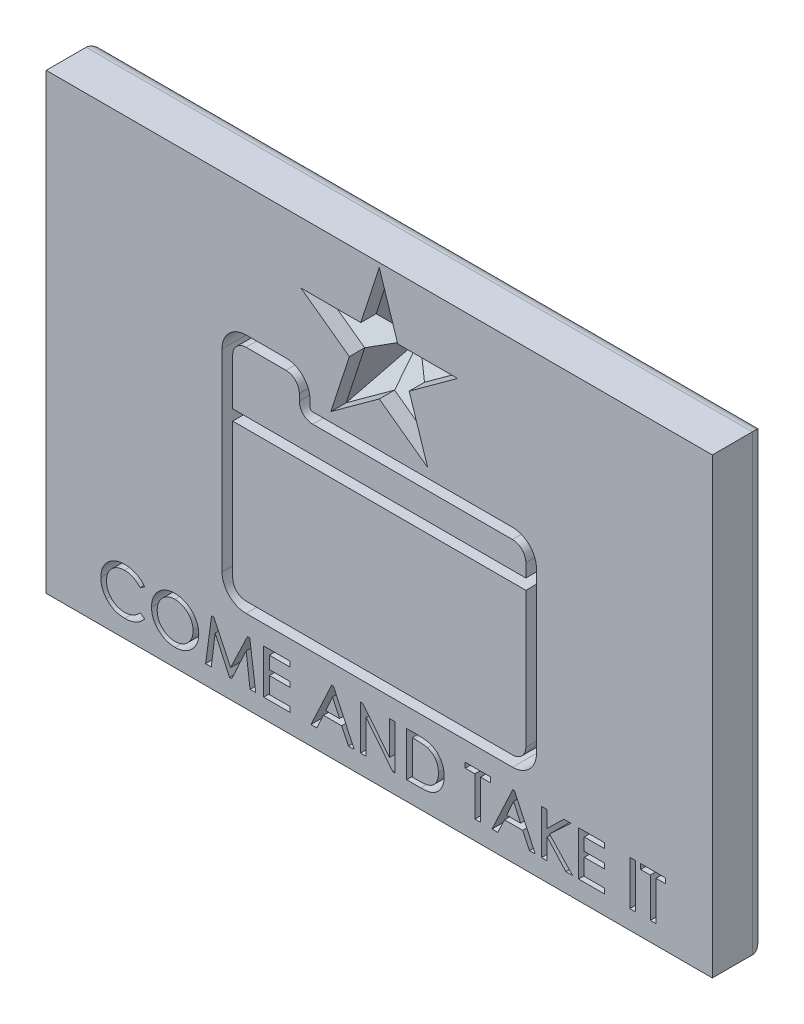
from build123d import *

# Parameters (mm, degrees)
SKETCH1_W           = 31.75
SKETCH1_H           = 21.59
BOSS_EXTRUDE1_DEPTH = 2.54
FILLET1_R           = 0.635
SKETCH2_W           = 0.271367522
SKETCH2_H           = 2.116666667
CUT_EXTRUDE1_DEPTH  = 1.905
CUT_EXTRUDE2_DEPTH  = 1.905
SKETCH4_W           = 13.97
SKETCH4_H           = 0.508
CUT_EXTRUDE3_DEPTH  = 1.905
CUT_EXTRUDE4_DEPTH  = 1.905
CHAMFER1_SIZE       = 1.17475


with BuildPart() as part:
    # Sketch1 → Boss-Extrude1 (new body)
    with BuildSketch(Plane.XY):
        Rectangle(SKETCH1_W, SKETCH1_H)
    extrude(amount=BOSS_EXTRUDE1_DEPTH)

    # Fillet1
    fillet1_edges = [part.edges().sort_by_distance(p)[0] for p in [
        (0, -10.795, 0),
        (-15.875, 0, 0),
        (0, 10.795, 0),
        (15.875, 0, 0),
    ]]
    fillet(fillet1_edges, radius=FILLET1_R)

    # Sketch2 → Cut-Extrude1 (cut)
    # profile 1 of 13: a face of its own
    with BuildSketch(Plane.XY.offset(2.54)):
        with BuildLine():
            Line((-11.18034188, -8.173790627), (-11.396587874, -8.323042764))
            add(Edge.make_bspline(
                [(-11.396587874, -8.323042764), (-11.422487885, -8.294673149), (-11.473190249, -8.239136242), (-11.556684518, -8.166386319), (-11.644064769, -8.105155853), (-11.735454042, -8.055648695), (-11.830949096, -8.016892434), (-11.931052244, -7.989963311), (-12.035868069, -7.973367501), (-12.107310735, -7.971311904), (-12.143696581, -7.970264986)],
                knots=[0, 0, 0, 0, 1.078723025, 2.111729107, 3.104379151, 4.071093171, 5.02612831, 5.993405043, 6.978038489, 8, 8, 8, 8], degree=3))
            add(Edge.make_bspline(
                [(-12.143696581, -7.970264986), (-12.162651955, -7.970538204), (-12.20036177, -7.971081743), (-12.256243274, -7.977057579), (-12.311270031, -7.985236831), (-12.365390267, -7.99766436), (-12.418507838, -8.013911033), (-12.470984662, -8.032752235), (-12.52202604, -8.05608894), (-12.572127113, -8.082027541), (-12.620536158, -8.111202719), (-12.666133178, -8.143606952), (-12.70974775, -8.177792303), (-12.750146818, -8.215375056), (-12.787699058, -8.255695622), (-12.82322706, -8.298246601), (-12.855832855, -8.34358146), (-12.885391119, -8.391564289), (-12.912352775, -8.441480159), (-12.934979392, -8.493694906), (-12.954623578, -8.54732275), (-12.970925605, -8.602642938), (-12.982982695, -8.659823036), (-12.991922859, -8.718707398), (-12.997652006, -8.779165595), (-12.998218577, -8.820113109), (-12.998504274, -8.840761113)],
                knots=[0, 0, 0, 0, 1.002068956, 1.993515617, 2.969284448, 3.943018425, 4.926742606, 5.905741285, 6.889351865, 7.892340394, 8.888397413, 9.875523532, 10.849114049, 11.817064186, 12.790109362, 13.76151668, 14.746886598, 15.740472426, 16.740336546, 17.744438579, 18.747064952, 19.759451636, 20.791569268, 21.834966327, 22.908270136, 24, 24, 24, 24], degree=3))
            add(Edge.make_bspline(
                [(-12.998504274, -8.840761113), (-12.997850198, -8.8717561), (-12.996569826, -8.932429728), (-12.984194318, -9.021271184), (-12.964884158, -9.105933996), (-12.937739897, -9.18641148), (-12.902666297, -9.262612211), (-12.859756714, -9.334411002), (-12.808764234, -9.401982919), (-12.750534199, -9.464454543), (-12.687057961, -9.521787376), (-12.61826118, -9.570840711), (-12.546499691, -9.613437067), (-12.470355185, -9.64725818), (-12.390903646, -9.674156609), (-12.307530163, -9.693210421), (-12.220493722, -9.704901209), (-12.161117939, -9.706304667), (-12.130976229, -9.707017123)],
                knots=[0, 0, 0, 0, 1.083728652, 2.12143175, 3.131304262, 4.117911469, 5.086904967, 6.060353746, 7.03835, 8.042493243, 9.043967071, 10.025107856, 10.993520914, 11.958418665, 12.934074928, 13.923564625, 14.94591178, 16, 16, 16, 16], degree=3))
            add(Edge.make_bspline(
                [(-12.130976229, -9.707017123), (-12.095998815, -9.705988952), (-12.026916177, -9.703958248), (-11.925338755, -9.68685354), (-11.827466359, -9.659226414), (-11.733193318, -9.620280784), (-11.642442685, -9.570399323), (-11.555640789, -9.509198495), (-11.472303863, -9.437231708), (-11.42164898, -9.382323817), (-11.39573985, -9.354239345)],
                knots=[0, 0, 0, 0, 0.996377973, 1.967910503, 2.926842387, 3.889624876, 4.868586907, 5.872161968, 6.91164629, 8, 8, 8, 8], degree=3))
            Line((-11.39573985, -9.354239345), (-11.18034188, -9.502643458))
            add(Edge.make_bspline(
                [(-11.18034188, -9.502643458), (-11.194285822, -9.520326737), (-11.22199062, -9.555461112), (-11.266731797, -9.605157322), (-11.313726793, -9.651896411), (-11.363438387, -9.695244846), (-11.415813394, -9.735160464), (-11.470606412, -9.772105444), (-11.52776479, -9.806021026), (-11.587257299, -9.836544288), (-11.648745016, -9.863863), (-11.712353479, -9.886868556), (-11.777473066, -9.907163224), (-11.844677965, -9.923051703), (-11.913705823, -9.935928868), (-11.98466355, -9.944572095), (-12.057240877, -9.950422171), (-12.106230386, -9.950970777), (-12.130976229, -9.951247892)],
                knots=[0, 0, 0, 0, 0.990136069, 1.967271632, 2.938597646, 3.903378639, 4.8655934, 5.832714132, 6.808088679, 7.786607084, 8.77175572, 9.76479442, 10.759640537, 11.769709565, 12.799869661, 13.846050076, 14.911985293, 16, 16, 16, 16], degree=3))
            add(Edge.make_bspline(
                [(-12.130976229, -9.951247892), (-12.153741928, -9.951093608), (-12.19861725, -9.950789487), (-12.264936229, -9.945679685), (-12.329497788, -9.938770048), (-12.392127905, -9.928403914), (-12.45312211, -9.915990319), (-12.511982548, -9.899531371), (-12.569507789, -9.881171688), (-12.624860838, -9.858968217), (-12.678459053, -9.834276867), (-12.730490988, -9.807215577), (-12.78044475, -9.776682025), (-12.828361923, -9.742972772), (-12.874806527, -9.706936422), (-12.919308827, -9.667770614), (-12.962331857, -9.625974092), (-12.988941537, -9.595821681), (-13.002320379, -9.580661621)],
                knots=[0, 0, 0, 0, 1.116169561, 2.200172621, 3.260333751, 4.299600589, 5.312386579, 6.311224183, 7.295427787, 8.272379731, 9.233840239, 10.188782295, 11.146938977, 12.102635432, 13.060741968, 14.028403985, 15.00871894, 16, 16, 16, 16], degree=3))
            add(Edge.make_bspline(
                [(-13.002320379, -9.580661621), (-13.02376716, -9.55433987), (-13.066278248, -9.502165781), (-13.120459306, -9.41735956), (-13.167191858, -9.329093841), (-13.204322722, -9.23611106), (-13.233671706, -9.139507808), (-13.255063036, -9.038989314), (-13.267388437, -8.934211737), (-13.269034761, -8.862983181), (-13.269871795, -8.826768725)],
                knots=[0, 0, 0, 0, 0.995996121, 1.974230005, 2.94855815, 3.923972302, 4.908363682, 5.909282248, 6.937024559, 8, 8, 8, 8], degree=3))
            add(Edge.make_bspline(
                [(-13.269871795, -8.826768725), (-13.268926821, -8.788697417), (-13.267067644, -8.713794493), (-13.251409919, -8.603839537), (-13.225897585, -8.498656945), (-13.190831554, -8.397792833), (-13.144365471, -8.302072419), (-13.088952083, -8.2102588), (-13.021938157, -8.124062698), (-12.946621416, -8.042737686), (-12.863757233, -7.968310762), (-12.774270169, -7.903770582), (-12.680071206, -7.84861777), (-12.580813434, -7.803437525), (-12.476227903, -7.76843727), (-12.366487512, -7.744223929), (-12.251827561, -7.728891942), (-12.173709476, -7.726998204), (-12.133944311, -7.726034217)],
                knots=[0, 0, 0, 0, 1.034323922, 2.034967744, 3.011348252, 3.972313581, 4.931003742, 5.898099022, 6.881526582, 7.89265862, 8.907395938, 9.903191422, 10.886146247, 11.869423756, 12.861842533, 13.877618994, 14.91962492, 16, 16, 16, 16], degree=3))
            add(Edge.make_bspline(
                [(-12.133944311, -7.726034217), (-12.108917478, -7.726324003), (-12.059366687, -7.726897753), (-11.985901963, -7.732566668), (-11.914301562, -7.741871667), (-11.844551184, -7.754688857), (-11.77644438, -7.770527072), (-11.710341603, -7.79117876), (-11.645868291, -7.814770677), (-11.583458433, -7.842008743), (-11.523265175, -7.872309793), (-11.465970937, -7.90649326), (-11.411179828, -7.943247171), (-11.359328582, -7.983337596), (-11.310071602, -8.026103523), (-11.263649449, -8.072037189), (-11.220303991, -8.12132488), (-11.193707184, -8.15624349), (-11.18034188, -8.173790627)],
                knots=[0, 0, 0, 0, 1.097463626, 2.172875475, 3.229307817, 4.262776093, 5.282168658, 6.293918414, 7.298043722, 8.291879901, 9.278790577, 10.251524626, 11.216027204, 12.170719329, 13.124142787, 14.075306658, 15.032812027, 16, 16, 16, 16], degree=3))
        make_face()
    # profile 2 of 13: a face of its own
    with BuildSketch(Plane.XY.offset(2.54)):
        with BuildLine():
            add(Edge.make_bspline(
                [(-9.755238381, -7.726034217), (-9.714624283, -7.726971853), (-9.634796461, -7.728814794), (-9.51768955, -7.744527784), (-9.40585614, -7.769665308), (-9.299461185, -7.805570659), (-9.198432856, -7.851576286), (-9.102611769, -7.907770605), (-9.012282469, -7.974323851), (-8.928549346, -8.050382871), (-8.852488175, -8.13323412), (-8.785081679, -8.220813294), (-8.729108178, -8.313508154), (-8.682317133, -8.409977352), (-8.64691212, -8.511115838), (-8.620680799, -8.616066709), (-8.60521022, -8.725533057), (-8.603313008, -8.800007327), (-8.602350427, -8.837793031)],
                knots=[0, 0, 0, 0, 1.090651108, 2.14369656, 3.167927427, 4.165692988, 5.154576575, 6.145033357, 7.14440862, 8.163220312, 9.178978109, 10.162394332, 11.12677451, 12.082874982, 13.037579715, 13.999894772, 14.985214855, 16, 16, 16, 16], degree=3))
            add(Edge.make_bspline(
                [(-8.602350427, -8.837793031), (-8.6032945, -8.875300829), (-8.605155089, -8.949221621), (-8.620922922, -9.058020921), (-8.646343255, -9.162844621), (-8.681942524, -9.263896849), (-8.728642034, -9.360406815), (-8.784895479, -9.45318423), (-8.851896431, -9.541342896), (-8.927673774, -9.62477411), (-9.010947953, -9.701106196), (-9.100362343, -9.768142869), (-9.194832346, -9.824566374), (-9.293887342, -9.871536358), (-9.398337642, -9.906800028), (-9.507403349, -9.932949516), (-9.621513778, -9.948399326), (-9.699222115, -9.950288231), (-9.738701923, -9.951247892)],
                knots=[0, 0, 0, 0, 1.015667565, 2.001689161, 2.971180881, 3.933912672, 4.898051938, 5.870540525, 6.8683264, 7.892867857, 8.919988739, 9.923897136, 10.914753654, 11.896185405, 12.887840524, 13.895451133, 14.930781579, 16, 16, 16, 16], degree=3))
            add(Edge.make_bspline(
                [(-9.738701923, -9.951247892), (-9.777200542, -9.950317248), (-9.852954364, -9.948486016), (-9.964086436, -9.932623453), (-10.070708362, -9.907894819), (-10.172682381, -9.87235508), (-10.270170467, -9.827024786), (-10.362617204, -9.770793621), (-10.450839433, -9.705301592), (-10.533159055, -9.630274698), (-10.608286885, -9.5481158), (-10.674185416, -9.46066078), (-10.730232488, -9.36902217), (-10.7758258, -9.273095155), (-10.811344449, -9.172788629), (-10.835984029, -9.068126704), (-10.851935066, -8.95940769), (-10.853769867, -8.885480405), (-10.854700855, -8.847969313)],
                knots=[0, 0, 0, 0, 1.056734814, 2.079339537, 3.076314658, 4.058285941, 5.039336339, 6.023146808, 7.024524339, 8.052147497, 9.076900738, 10.077495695, 11.054668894, 12.021676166, 12.988994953, 13.970866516, 14.970407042, 16, 16, 16, 16], degree=3))
            add(Edge.make_bspline(
                [(-10.854700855, -8.847969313), (-10.854377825, -8.822791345), (-10.853735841, -8.77275304), (-10.845995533, -8.698449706), (-10.834786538, -8.625333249), (-10.818637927, -8.553649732), (-10.79780879, -8.4833864), (-10.772135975, -8.414690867), (-10.742731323, -8.346982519), (-10.707658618, -8.281605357), (-10.669579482, -8.218179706), (-10.627265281, -8.158409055), (-10.582506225, -8.101565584), (-10.533417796, -8.049166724), (-10.48164127, -7.999676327), (-10.426330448, -7.953858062), (-10.3678245, -7.911297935), (-10.30587123, -7.872943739), (-10.241997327, -7.838255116), (-10.176152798, -7.808487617), (-10.109231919, -7.782938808), (-10.040921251, -7.762231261), (-9.971402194, -7.745883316), (-9.900523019, -7.734751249), (-9.828340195, -7.72699559), (-9.779710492, -7.726356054), (-9.755238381, -7.726034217)],
                knots=[0, 0, 0, 0, 1.036913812, 2.060746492, 3.074578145, 4.08324605, 5.085523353, 6.091481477, 7.103103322, 8.124200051, 9.145827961, 10.149052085, 11.139400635, 12.124186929, 13.104469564, 14.088618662, 15.081002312, 16.082788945, 17.088477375, 18.073521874, 19.057670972, 20.037642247, 21.012252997, 21.997331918, 22.992189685, 24, 24, 24, 24], degree=3))
        make_face()
        with BuildLine():
            add(Edge.make_bspline(
                [(-9.746334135, -7.970264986), (-9.764158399, -7.970547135), (-9.799611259, -7.971108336), (-9.852426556, -7.976982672), (-9.904694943, -7.985806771), (-9.956506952, -7.998216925), (-10.007905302, -8.01372367), (-10.058447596, -8.03356115), (-10.108622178, -8.056258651), (-10.157534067, -8.083163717), (-10.205214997, -8.112369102), (-10.250314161, -8.144973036), (-10.293349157, -8.179629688), (-10.333699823, -8.217506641), (-10.371290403, -8.25810801), (-10.406329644, -8.301367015), (-10.439084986, -8.347134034), (-10.46883914, -8.395726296), (-10.496320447, -8.446138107), (-10.519453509, -8.498695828), (-10.539048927, -8.552840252), (-10.555131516, -8.608514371), (-10.568016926, -8.665828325), (-10.576637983, -8.724803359), (-10.582530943, -8.785378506), (-10.583063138, -8.826330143), (-10.583333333, -8.84712129)],
                knots=[0, 0, 0, 0, 0.951425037, 1.892405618, 2.834142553, 3.780555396, 4.735506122, 5.698386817, 6.677778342, 7.674036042, 8.677244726, 9.661625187, 10.643485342, 11.625954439, 12.613944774, 13.595804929, 14.596853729, 15.616869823, 16.636634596, 17.660413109, 18.67984269, 19.709280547, 20.753005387, 21.813969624, 22.890152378, 24, 24, 24, 24], degree=3))
            add(Edge.make_bspline(
                [(-10.583333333, -8.84712129), (-10.582676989, -8.877410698), (-10.581389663, -8.936819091), (-10.568974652, -9.023959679), (-10.549727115, -9.107228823), (-10.522483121, -9.186542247), (-10.487403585, -9.261875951), (-10.444468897, -9.333208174), (-10.393607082, -9.40071766), (-10.335424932, -9.46310712), (-10.272349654, -9.52011376), (-10.205445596, -9.569788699), (-10.136244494, -9.612743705), (-10.063635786, -9.647173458), (-9.988331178, -9.674005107), (-9.910202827, -9.693097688), (-9.829236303, -9.704902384), (-9.774217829, -9.706305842), (-9.746334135, -9.707017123)],
                knots=[0, 0, 0, 0, 1.087324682, 2.132633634, 3.154656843, 4.153212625, 5.138884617, 6.133989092, 7.13811672, 8.169089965, 9.193543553, 10.187520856, 11.158295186, 12.114249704, 13.068004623, 14.02467326, 14.998892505, 16, 16, 16, 16], degree=3))
            add(Edge.make_bspline(
                [(-9.746334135, -9.707017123), (-9.726533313, -9.70673423), (-9.687276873, -9.706173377), (-9.629083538, -9.70038099), (-9.572041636, -9.691449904), (-9.516117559, -9.679427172), (-9.461477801, -9.662845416), (-9.407710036, -9.643769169), (-9.355404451, -9.619979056), (-9.304185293, -9.593660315), (-9.255360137, -9.563392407), (-9.208378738, -9.531215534), (-9.16419051, -9.49620444), (-9.123642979, -9.457659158), (-9.085083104, -9.417325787), (-9.049557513, -9.374072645), (-9.016817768, -9.328182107), (-8.987192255, -9.279801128), (-8.960619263, -9.22950924), (-8.937000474, -9.177679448), (-8.917803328, -9.124235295), (-8.901330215, -9.069699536), (-8.88918447, -9.013515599), (-8.880402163, -8.956023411), (-8.874539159, -8.897134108), (-8.873993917, -8.857453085), (-8.873717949, -8.837369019)],
                knots=[0, 0, 0, 0, 1.036970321, 2.055862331, 3.060095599, 4.060719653, 5.049301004, 6.049377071, 7.046955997, 8.056986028, 9.063944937, 10.053856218, 11.039021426, 12.013303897, 12.982198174, 13.960523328, 14.942567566, 15.933032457, 16.929951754, 17.920776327, 18.913894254, 19.902475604, 20.903099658, 21.921964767, 22.948227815, 24, 24, 24, 24], degree=3))
            add(Edge.make_bspline(
                [(-8.873717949, -8.837369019), (-8.873995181, -8.817426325), (-8.874542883, -8.778027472), (-8.880372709, -8.719698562), (-8.88917418, -8.662909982), (-8.901405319, -8.607455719), (-8.917719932, -8.553578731), (-8.937015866, -8.500866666), (-8.960620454, -8.449880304), (-8.987208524, -8.400444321), (-9.016891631, -8.352705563), (-9.050011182, -8.307559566), (-9.085657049, -8.264484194), (-9.124357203, -8.224114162), (-9.166137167, -8.186302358), (-9.210600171, -8.150765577), (-9.257880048, -8.117366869), (-9.308093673, -8.08728911), (-9.359900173, -8.059652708), (-9.413023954, -8.0360847), (-9.466546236, -8.015458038), (-9.520960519, -7.998887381), (-9.576256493, -7.986252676), (-9.632296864, -7.976826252), (-9.68911573, -7.971159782), (-9.727241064, -7.970563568), (-9.746334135, -7.970264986)],
                knots=[0, 0, 0, 0, 1.048789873, 2.071992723, 3.080474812, 4.070813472, 5.056451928, 6.039816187, 7.021295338, 8.009314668, 8.991328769, 9.975844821, 10.952581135, 11.930703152, 12.91499457, 13.914777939, 14.923479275, 15.957618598, 16.991998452, 18.010408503, 19.012925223, 20.00783076, 20.999814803, 21.994803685, 22.995802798, 24, 24, 24, 24], degree=3))
        make_face(mode=Mode.SUBTRACT)
    # profile 3 of 13: a face of its own
    with BuildSketch(Plane.XY.offset(2.54)):
        Polygon((-8.276709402, -9.896974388), (-7.993893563, -7.780307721), (-7.887042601, -7.780307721), (-7.084388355, -9.462786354), (-6.281734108, -7.780307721), (-6.173187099, -7.780307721), (-5.888675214, -9.896974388), (-6.157922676, -9.896974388), (-6.346183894, -8.40445302), (-7.033082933, -9.896974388), (-7.135693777, -9.896974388), (-7.820472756, -8.40445302), (-8.007885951, -9.896974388), align=None)
    # profile 4 of 13: a face of its own
    with BuildSketch(Plane.XY.offset(2.54)):
        Polygon((-5.508760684, -7.780307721), (-4.260470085, -7.780307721), (-4.260470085, -8.02453849), (-5.237393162, -8.02453849), (-5.237393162, -8.621547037), (-4.260470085, -8.621547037), (-4.260470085, -8.865777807), (-5.237393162, -8.865777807), (-5.237393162, -9.652743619), (-4.260470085, -9.652743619), (-4.260470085, -9.896974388), (-5.508760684, -9.896974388), align=None)
    # profile 5 of 13: a face of its own
    with BuildSketch(Plane.XY.offset(2.54)):
        Polygon((-2.184508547, -7.780307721), (-1.194017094, -9.896974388), (-1.472592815, -9.896974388), (-1.793993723, -9.218555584), (-2.659825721, -9.218555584), (-2.981226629, -9.896974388), (-3.256410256, -9.896974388), (-2.269310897, -7.780307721), align=None)
        Polygon((-2.226909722, -8.242904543), (-2.556366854, -8.974324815), (-1.894060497, -8.974324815), align=None, mode=Mode.SUBTRACT)
    # profile 6 of 13: a face of its own
    with BuildSketch(Plane.XY.offset(2.54)):
        Polygon((-0.895512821, -9.896974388), (-0.895512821, -7.780307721), (-0.795022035, -7.780307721), (0.488461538, -9.388584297), (0.488461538, -7.780307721), (0.75982906, -7.780307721), (0.75982906, -9.896974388), (0.648737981, -9.896974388), (-0.624145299, -8.29293793), (-0.624145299, -9.896974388), align=None)
    # profile 7 of 13: a face of its own
    with BuildSketch(Plane.XY.offset(2.54)):
        with BuildLine():
            Line((1.302564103, -9.896974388), (1.302564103, -7.780307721))
            Line((1.302564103, -7.780307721), (1.750744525, -7.780307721))
            add(Edge.make_bspline(
                [(1.750744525, -7.780307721), (1.788484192, -7.780570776), (1.861152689, -7.781077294), (1.966205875, -7.784399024), (2.063088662, -7.790110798), (2.152008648, -7.798720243), (2.2328765, -7.808845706), (2.305666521, -7.822241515), (2.370656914, -7.83668213), (2.410452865, -7.84996211), (2.429163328, -7.856205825)],
                knots=[0, 0, 0, 0, 1.321377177, 2.544338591, 3.679698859, 4.71869479, 5.671952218, 6.531967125, 7.309789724, 8, 8, 8, 8], degree=3))
            add(Edge.make_bspline(
                [(2.429163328, -7.856205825), (2.45536003, -7.866077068), (2.507065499, -7.885560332), (2.580325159, -7.92213293), (2.649537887, -7.962256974), (2.713841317, -8.007802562), (2.773112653, -8.058482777), (2.828369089, -8.113190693), (2.877905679, -8.173521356), (2.923281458, -8.237772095), (2.963486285, -8.306017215), (2.998287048, -8.377360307), (3.027679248, -8.451664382), (3.051851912, -8.528740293), (3.070377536, -8.608726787), (3.084066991, -8.691406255), (3.092246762, -8.776992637), (3.093138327, -8.835089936), (3.093589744, -8.864505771)],
                knots=[0, 0, 0, 0, 1.037989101, 2.048720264, 3.03347809, 4.003905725, 4.967380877, 5.923996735, 6.884742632, 7.859453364, 8.839691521, 9.819957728, 10.801471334, 11.80152298, 12.813966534, 13.844978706, 14.908869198, 16, 16, 16, 16], degree=3))
            add(Edge.make_bspline(
                [(3.093589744, -8.864505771), (3.093195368, -8.889960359), (3.092416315, -8.940243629), (3.085826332, -9.014714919), (3.075397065, -9.087096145), (3.060489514, -9.157340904), (3.041428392, -9.225349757), (3.017945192, -9.2913137), (2.990569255, -9.355316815), (2.958653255, -9.416630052), (2.923668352, -9.475069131), (2.885419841, -9.529792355), (2.844669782, -9.580818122), (2.801324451, -9.628151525), (2.754980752, -9.671541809), (2.705699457, -9.710955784), (2.65377189, -9.746796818), (2.598695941, -9.778817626), (2.539442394, -9.807286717), (2.474919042, -9.831181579), (2.404998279, -9.851393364), (2.329750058, -9.868578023), (2.248779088, -9.880811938), (2.162486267, -9.890071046), (2.070822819, -9.896303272), (2.007847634, -9.89674651), (1.975470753, -9.896974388)],
                knots=[0, 0, 0, 0, 1.058131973, 2.090245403, 3.105765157, 4.096918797, 5.07359586, 6.040054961, 7.006085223, 7.965371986, 8.911666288, 9.835956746, 10.738988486, 11.624821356, 12.502036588, 13.375701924, 14.24610047, 15.122941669, 16.021834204, 16.975760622, 17.979893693, 19.046217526, 20.182340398, 21.382202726, 22.654134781, 24, 24, 24, 24], degree=3))
            Line((1.975470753, -9.896974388), (1.302564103, -9.896974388))
        make_face()
        with BuildLine():
            Line((1.573931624, -9.652743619), (1.757952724, -9.652743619))
            add(Edge.make_bspline(
                [(1.757952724, -9.652743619), (1.791876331, -9.652612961), (1.85704835, -9.652361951), (1.950757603, -9.649579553), (2.036331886, -9.646257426), (2.113496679, -9.640089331), (2.182421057, -9.633205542), (2.243106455, -9.624310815), (2.295800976, -9.614308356), (2.327598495, -9.60491549), (2.342240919, -9.600590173)],
                knots=[0, 0, 0, 0, 1.383618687, 2.658126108, 3.823786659, 4.876093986, 5.815132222, 6.648351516, 7.377580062, 8, 8, 8, 8], degree=3))
            add(Edge.make_bspline(
                [(2.342240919, -9.600590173), (2.360441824, -9.594083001), (2.396394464, -9.581229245), (2.44791023, -9.557310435), (2.496462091, -9.52971996), (2.541887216, -9.498209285), (2.584569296, -9.463192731), (2.624542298, -9.424709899), (2.66109542, -9.381969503), (2.694454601, -9.335821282), (2.72468165, -9.286579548), (2.750953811, -9.234405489), (2.773176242, -9.179404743), (2.790719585, -9.121710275), (2.804897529, -9.061395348), (2.814985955, -8.998350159), (2.820940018, -8.932462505), (2.821789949, -8.887697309), (2.822222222, -8.864929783)],
                knots=[0, 0, 0, 0, 0.982760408, 1.941267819, 2.884666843, 3.819923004, 4.749609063, 5.690155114, 6.638335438, 7.60609908, 8.583824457, 9.574050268, 10.573936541, 11.597196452, 12.638231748, 13.723193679, 14.842018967, 16, 16, 16, 16], degree=3))
            add(Edge.make_bspline(
                [(2.822222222, -8.864929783), (2.821881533, -8.841024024), (2.821210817, -8.79396055), (2.813931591, -8.724758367), (2.803757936, -8.658074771), (2.788435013, -8.594107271), (2.768244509, -8.533054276), (2.744815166, -8.474224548), (2.716064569, -8.418524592), (2.68354809, -8.36559384), (2.647220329, -8.315984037), (2.607065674, -8.270452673), (2.563824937, -8.228515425), (2.516450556, -8.191437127), (2.466286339, -8.157450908), (2.412300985, -8.128466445), (2.355083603, -8.1030192), (2.315089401, -8.089782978), (2.294751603, -8.083052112)],
                knots=[0, 0, 0, 0, 1.129217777, 2.223100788, 3.284889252, 4.31516385, 5.326848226, 6.321524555, 7.304244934, 8.284784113, 9.254596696, 10.205833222, 11.15055266, 12.096616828, 13.045035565, 14.010353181, 14.988227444, 16, 16, 16, 16], degree=3))
            add(Edge.make_bspline(
                [(2.294751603, -8.083052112), (2.277558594, -8.078322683), (2.241037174, -8.06827642), (2.181510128, -8.056676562), (2.114431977, -8.046732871), (2.03949252, -8.038210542), (1.95703253, -8.031991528), (1.866667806, -8.028094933), (1.768717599, -8.02482144), (1.700714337, -8.02463499), (1.665518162, -8.02453849)],
                knots=[0, 0, 0, 0, 0.675026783, 1.433893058, 2.294494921, 3.24250292, 4.28921909, 5.425097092, 6.667317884, 8, 8, 8, 8], degree=3))
            Line((1.665518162, -8.02453849), (1.573931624, -8.02453849))
            Line((1.573931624, -8.02453849), (1.573931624, -9.652743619))
        make_face(mode=Mode.SUBTRACT)
    # profile 8 of 13: a face of its own
    with BuildSketch(Plane.XY.offset(2.54)):
        Polygon((4.097649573, -8.02453849), (4.097649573, -7.780307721), (5.291666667, -7.780307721), (5.291666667, -8.02453849), (4.83034188, -8.02453849), (4.83034188, -9.896974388), (4.558974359, -9.896974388), (4.558974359, -8.02453849), align=None)
    # profile 9 of 13: a face of its own
    with BuildSketch(Plane.XY.offset(2.54)):
        Polygon((6.444978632, -7.780307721), (7.435470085, -9.896974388), (7.156894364, -9.896974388), (6.835493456, -9.218555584), (5.969661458, -9.218555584), (5.64826055, -9.896974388), (5.373076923, -9.896974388), (6.360176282, -7.780307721), align=None)
        Polygon((6.402577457, -8.242904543), (6.073120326, -8.974324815), (6.735426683, -8.974324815), align=None, mode=Mode.SUBTRACT)
    # profile 10 of 13: a face of its own
    with BuildSketch(Plane.XY.offset(2.54)):
        Polygon((7.733974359, -7.780307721), (8.00534188, -7.780307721), (8.00534188, -8.557097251), (8.795275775, -7.780307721), (9.131517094, -7.780307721), (8.116432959, -8.73094207), (9.21292735, -9.896974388), (8.893222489, -9.896974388), (8.00534188, -8.904786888), (8.00534188, -9.896974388), (7.733974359, -9.896974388), align=None)
    # profile 11 of 13: a face of its own
    with BuildSketch(Plane.XY.offset(2.54)):
        Polygon((9.497863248, -7.780307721), (10.746153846, -7.780307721), (10.746153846, -8.02453849), (9.769230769, -8.02453849), (9.769230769, -8.621547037), (10.746153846, -8.621547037), (10.746153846, -8.865777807), (9.769230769, -8.865777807), (9.769230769, -9.652743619), (10.746153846, -9.652743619), (10.746153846, -9.896974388), (9.497863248, -9.896974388), align=None)
    # profile 12 of 13: a face of its own
    with BuildSketch(Plane.XY.offset(2.54)):
        with Locations((12.075854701, -8.838641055)):
            Rectangle(SKETCH2_W, SKETCH2_H)
    # profile 13 of 13: a face of its own
    with BuildSketch(Plane.XY.offset(2.54)):
        Polygon((12.455769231, -8.02453849), (12.455769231, -7.780307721), (13.649786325, -7.780307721), (13.649786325, -8.02453849), (13.188461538, -8.02453849), (13.188461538, -9.896974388), (12.917094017, -9.896974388), (12.917094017, -8.02453849), align=None)
    extrude(amount=-CUT_EXTRUDE1_DEPTH, mode=Mode.SUBTRACT)

    # Sketch3 → Cut-Extrude2 (cut)
    with BuildSketch(Plane.XY.offset(2.54)):
        with BuildLine():
            Line((-7.493, -5.715), (-7.493, 2.54))
            Line((-7.493, 2.54), (-7.493, 3.4925))
            ThreePointArc((-7.493, 3.4925), (-7.158223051, 4.300723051), (-6.35, 4.6355))
            Line((-6.35, 4.6355), (-4.445, 4.6355))
            ThreePointArc((-4.445, 4.6355), (-3.636776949, 4.300723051), (-3.302, 3.4925))
            Line((-3.302, 3.4925), (-3.302, 3.175))
            ThreePointArc((-3.302, 3.175), (-3.264802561, 3.085197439), (-3.175, 3.048))
            Line((-3.175, 3.048), (6.35, 3.048))
            ThreePointArc((6.35, 3.048), (7.158223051, 2.713223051), (7.493, 1.905))
            Line((7.493, 1.905), (7.493, -5.715))
            ThreePointArc((7.493, -5.715), (7.158223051, -6.523223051), (6.35, -6.858))
            Line((6.35, -6.858), (-6.35, -6.858))
            ThreePointArc((-6.35, -6.858), (-7.158223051, -6.523223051), (-7.493, -5.715))
        make_face()
        with BuildLine():
            Line((6.35, 2.54), (-3.175, 2.54))
            ThreePointArc((-3.175, 2.54), (-3.624012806, 2.725987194), (-3.81, 3.175))
            Line((-3.81, 3.175), (-3.81, 3.4925))
            ThreePointArc((-3.81, 3.4925), (-3.995987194, 3.941512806), (-4.445, 4.1275))
            Line((-4.445, 4.1275), (-6.35, 4.1275))
            ThreePointArc((-6.35, 4.1275), (-6.799012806, 3.941512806), (-6.985, 3.4925))
            Line((-6.985, 3.4925), (-6.985, 2.54))
            Line((-6.985, 2.54), (-6.985, -5.715))
            ThreePointArc((-6.985, -5.715), (-6.799012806, -6.164012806), (-6.35, -6.35))
            Line((-6.35, -6.35), (6.35, -6.35))
            ThreePointArc((6.35, -6.35), (6.799012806, -6.164012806), (6.985, -5.715))
            Line((6.985, -5.715), (6.985, 1.905))
            ThreePointArc((6.985, 1.905), (6.799012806, 2.354012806), (6.35, 2.54))
        make_face(mode=Mode.SUBTRACT)
    extrude(amount=-CUT_EXTRUDE2_DEPTH, mode=Mode.SUBTRACT)

    # Sketch4 → Cut-Extrude3 (cut)
    with BuildSketch(Plane.XY.offset(2.54)):
        with Locations((0, 1.016)):
            Rectangle(SKETCH4_W, SKETCH4_H)
    extrude(amount=-CUT_EXTRUDE3_DEPTH, mode=Mode.SUBTRACT)

    # Sketch5 → Cut-Extrude4 (cut)
    with BuildSketch(Plane.XY.offset(2.54)):
        Polygon((-0.881108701, 7.880242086), (0, 10.592015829), (0.881108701, 7.880242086), (3.732436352, 7.880242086), (1.425663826, 6.204273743), (2.306772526, 3.4925), (0, 5.168468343), (-2.306772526, 3.4925), (-1.425663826, 6.204273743), (-3.732436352, 7.880242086), align=None)
    extrude(amount=-CUT_EXTRUDE4_DEPTH, mode=Mode.SUBTRACT)

    # Chamfer1
    chamfer1_edges = [part.edges().sort_by_distance(p)[0] for p in [
        (-2.579050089, 7.042257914, 0.635),
        (-2.306772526, 7.880242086, 0.635),
        (-0.44055435, 9.236128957, 0.635),
        (0.44055435, 9.236128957, 0.635),
        (2.306772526, 7.880242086, 0.635),
        (2.579050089, 7.042257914, 0.635),
        (1.866218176, 4.848386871, 0.635),
        (1.153386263, 4.330484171, 0.635),
        (-1.153386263, 4.330484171, 0.635),
        (-1.866218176, 4.848386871, 0.635),
    ]]
    chamfer(chamfer1_edges, length=CHAMFER1_SIZE)


solid = part.part
